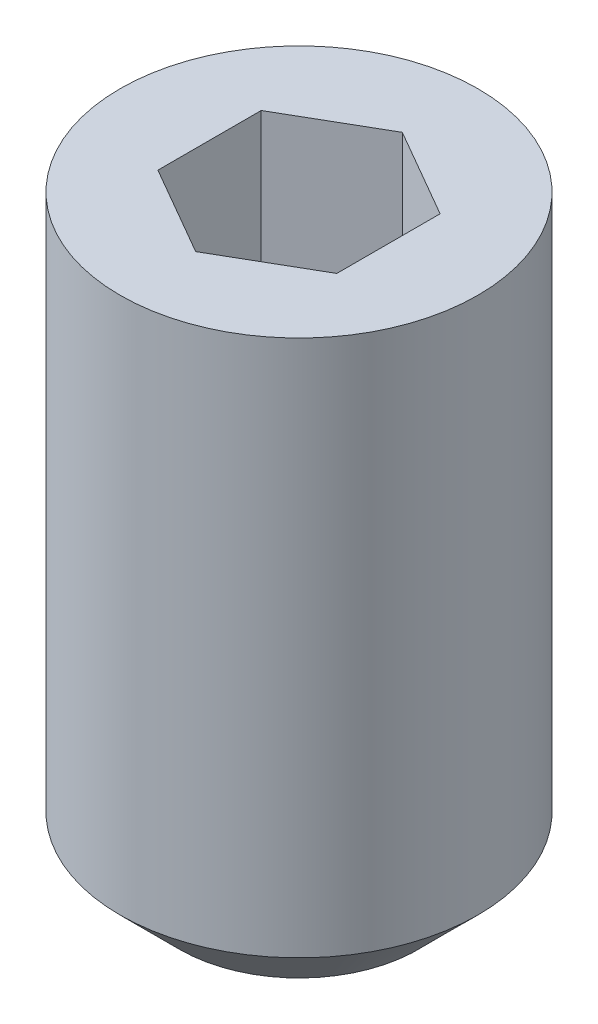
ISO-10303-21;
HEADER;
FILE_DESCRIPTION(('STEP AP214'),'2;1');
FILE_NAME('part.step','',(''),(''),'','','');
FILE_SCHEMA(('AUTOMOTIVE_DESIGN { 1 0 10303 214 1 1 1 1 }'));
ENDSEC;
DATA;
#1=APPLICATION_CONTEXT('core data for automotive mechanical design processes');
#2=APPLICATION_PROTOCOL_DEFINITION('international standard','automotive_design',2000,#1);
#3=PRODUCT_CONTEXT('',#1,'mechanical');
#4=PRODUCT('Part','Part','',(#3));
#5=PRODUCT_RELATED_PRODUCT_CATEGORY('part','',(#4));
#6=PRODUCT_DEFINITION_FORMATION('','',#4);
#7=PRODUCT_DEFINITION_CONTEXT('part definition',#1,'design');
#8=PRODUCT_DEFINITION('design','',#6,#7);
#9=PRODUCT_DEFINITION_SHAPE('','',#8);
#10=(LENGTH_UNIT() NAMED_UNIT(*) SI_UNIT(.MILLI.,.METRE.));
#11=(NAMED_UNIT(*) PLANE_ANGLE_UNIT() SI_UNIT($,.RADIAN.));
#12=(NAMED_UNIT(*) SI_UNIT($,.STERADIAN.) SOLID_ANGLE_UNIT());
#13=UNCERTAINTY_MEASURE_WITH_UNIT(LENGTH_MEASURE(1.E-05),#10,'distance_accuracy_value','');
#14=(GEOMETRIC_REPRESENTATION_CONTEXT(3) GLOBAL_UNCERTAINTY_ASSIGNED_CONTEXT((#13)) GLOBAL_UNIT_ASSIGNED_CONTEXT((#10,
#11,#12)) REPRESENTATION_CONTEXT('',''));
#15=CARTESIAN_POINT('',(0.,0.,0.));
#16=DIRECTION('',(0.,0.,1.));
#17=DIRECTION('',(1.,0.,0.));
#18=AXIS2_PLACEMENT_3D('',#15,#16,#17);
#19=CARTESIAN_POINT('',(0.750000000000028,-3.79166666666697,0.));
#20=DIRECTION('',(0.362446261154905,-0.932004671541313,0.));
#21=DIRECTION('',(0.932004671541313,0.362446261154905,0.));
#22=AXIS2_PLACEMENT_3D('',#19,#20,#21);
#23=PLANE('',#22);
#24=DIRECTION('',(0.820729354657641,0.319172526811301,0.473848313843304));
#25=VECTOR('',#24,1.);
#26=CARTESIAN_POINT('',(0.,-4.08333333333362,1.63206308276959E-13));
#27=LINE('',#26,#25);
#28=CARTESIAN_POINT('',(0.,-4.08333333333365,1.38708859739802E-13));
#29=VERTEX_POINT('',#28);
#30=CARTESIAN_POINT('',(1.50000000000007,-3.50000000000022,0.866025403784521));
#31=VERTEX_POINT('',#30);
#32=EDGE_CURVE('E97',#29,#31,#27,.T.);
#33=ORIENTED_EDGE('',*,*,#32,.T.);
#34=DIRECTION('',(0.,0.,1.));
#35=VECTOR('',#34,1.);
#36=CARTESIAN_POINT('',(1.50000000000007,-3.50000000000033,0.));
#37=LINE('',#36,#35);
#38=CARTESIAN_POINT('',(1.50000000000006,-3.50000000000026,-0.866025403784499));
#39=VERTEX_POINT('',#38);
#40=EDGE_CURVE('E69',#39,#31,#37,.T.);
#41=ORIENTED_EDGE('',*,*,#40,.F.);
#42=DIRECTION('',(-0.820729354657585,-0.319172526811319,0.473848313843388));
#43=VECTOR('',#42,1.);
#44=CARTESIAN_POINT('',(1.50000000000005,-3.50000000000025,-0.866025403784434));
#45=LINE('',#44,#43);
#46=EDGE_CURVE('E86',#39,#29,#45,.T.);
#47=ORIENTED_EDGE('',*,*,#46,.T.);
#48=EDGE_LOOP('',(#33,#41,#47));
#49=FACE_BOUND('',#48,.T.);
#50=ADVANCED_FACE('F16',(#49),#23,.F.);
#51=CARTESIAN_POINT('',(0.375000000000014,-3.79166666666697,-0.649519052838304));
#52=DIRECTION('',(0.181223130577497,-0.932004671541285,-0.313887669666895));
#53=DIRECTION('',(0.,0.319172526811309,-0.947696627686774));
#54=AXIS2_PLACEMENT_3D('',#51,#52,#53);
#55=PLANE('',#54);
#56=ORIENTED_EDGE('',*,*,#46,.F.);
#57=DIRECTION('',(0.86602540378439,0.,0.500000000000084));
#58=VECTOR('',#57,1.);
#59=CARTESIAN_POINT('',(0.,-3.50000000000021,-1.73205080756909));
#60=LINE('',#59,#58);
#61=CARTESIAN_POINT('',(0.,-3.50000000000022,-1.73205080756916));
#62=VERTEX_POINT('',#61);
#63=EDGE_CURVE('E75',#62,#39,#60,.T.);
#64=ORIENTED_EDGE('',*,*,#63,.F.);
#65=DIRECTION('',(0.,0.319172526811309,-0.947696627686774));
#66=VECTOR('',#65,1.);
#67=CARTESIAN_POINT('',(0.,-3.85715523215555,-0.671574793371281));
#68=LINE('',#67,#66);
#69=EDGE_CURVE('E101',#62,#29,#68,.F.);
#70=ORIENTED_EDGE('',*,*,#69,.T.);
#71=EDGE_LOOP('',(#56,#64,#70));
#72=FACE_BOUND('',#71,.T.);
#73=ADVANCED_FACE('F100',(#72),#55,.F.);
#74=CARTESIAN_POINT('',(0.375000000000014,-3.79166666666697,0.649519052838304));
#75=DIRECTION('',(0.181223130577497,-0.932004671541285,0.313887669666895));
#76=DIRECTION('',(0.,-0.319172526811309,-0.947696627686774));
#77=AXIS2_PLACEMENT_3D('',#74,#75,#76);
#78=PLANE('',#77);
#79=DIRECTION('',(0.,-0.319172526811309,-0.947696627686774));
#80=VECTOR('',#79,1.);
#81=CARTESIAN_POINT('',(-1.18015406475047E-13,-3.85715523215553,0.671574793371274));
#82=LINE('',#81,#80);
#83=CARTESIAN_POINT('',(0.,-3.50000000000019,1.73205080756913));
#84=VERTEX_POINT('',#83);
#85=EDGE_CURVE('E142',#29,#84,#82,.F.);
#86=ORIENTED_EDGE('',*,*,#85,.T.);
#87=DIRECTION('',(-0.866025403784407,0.,0.500000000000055));
#88=VECTOR('',#87,1.);
#89=CARTESIAN_POINT('',(1.50000000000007,-3.50000000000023,0.866025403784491));
#90=LINE('',#89,#88);
#91=EDGE_CURVE('E102',#31,#84,#90,.T.);
#92=ORIENTED_EDGE('',*,*,#91,.F.);
#93=ORIENTED_EDGE('',*,*,#32,.F.);
#94=EDGE_LOOP('',(#86,#92,#93));
#95=FACE_BOUND('',#94,.T.);
#96=ADVANCED_FACE('F172',(#95),#78,.F.);
#97=CARTESIAN_POINT('',(-0.375000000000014,-3.79166666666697,-0.649519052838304));
#98=DIRECTION('',(-0.181223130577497,-0.932004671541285,-0.313887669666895));
#99=DIRECTION('',(0.,0.319172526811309,-0.947696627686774));
#100=AXIS2_PLACEMENT_3D('',#97,#98,#99);
#101=PLANE('',#100);
#102=ORIENTED_EDGE('',*,*,#69,.F.);
#103=DIRECTION('',(0.86602540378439,0.,-0.500000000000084));
#104=VECTOR('',#103,1.);
#105=CARTESIAN_POINT('',(-1.50000000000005,-3.50000000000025,-0.866025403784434));
#106=LINE('',#105,#104);
#107=CARTESIAN_POINT('',(-1.50000000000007,-3.50000000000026,-0.866025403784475));
#108=VERTEX_POINT('',#107);
#109=EDGE_CURVE('E148',#108,#62,#106,.T.);
#110=ORIENTED_EDGE('',*,*,#109,.F.);
#111=DIRECTION('',(0.820729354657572,-0.319172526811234,0.473848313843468));
#112=VECTOR('',#111,1.);
#113=CARTESIAN_POINT('',(-1.50000000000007,-3.50000000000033,-0.866025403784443));
#114=LINE('',#113,#112);
#115=EDGE_CURVE('E139',#108,#29,#114,.T.);
#116=ORIENTED_EDGE('',*,*,#115,.T.);
#117=EDGE_LOOP('',(#102,#110,#116));
#118=FACE_BOUND('',#117,.T.);
#119=ADVANCED_FACE('F155',(#118),#101,.F.);
#120=CARTESIAN_POINT('',(-0.375000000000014,-3.79166666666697,0.649519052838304));
#121=DIRECTION('',(-0.181223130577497,-0.932004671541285,0.313887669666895));
#122=DIRECTION('',(0.,-0.319172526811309,-0.947696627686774));
#123=AXIS2_PLACEMENT_3D('',#120,#121,#122);
#124=PLANE('',#123);
#125=DIRECTION('',(-0.820729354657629,0.319172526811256,0.473848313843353));
#126=VECTOR('',#125,1.);
#127=CARTESIAN_POINT('',(-1.15792792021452E-13,-4.08333333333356,1.38777878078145E-13));
#128=LINE('',#127,#126);
#129=CARTESIAN_POINT('',(-1.50000000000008,-3.50000000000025,0.866025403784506));
#130=VERTEX_POINT('',#129);
#131=EDGE_CURVE('E136',#29,#130,#128,.T.);
#132=ORIENTED_EDGE('',*,*,#131,.T.);
#133=DIRECTION('',(-0.866025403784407,0.,-0.500000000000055));
#134=VECTOR('',#133,1.);
#135=CARTESIAN_POINT('',(0.,-3.50000000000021,1.73205080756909));
#136=LINE('',#135,#134);
#137=EDGE_CURVE('E145',#84,#130,#136,.T.);
#138=ORIENTED_EDGE('',*,*,#137,.F.);
#139=ORIENTED_EDGE('',*,*,#85,.F.);
#140=EDGE_LOOP('',(#132,#138,#139));
#141=FACE_BOUND('',#140,.T.);
#142=ADVANCED_FACE('F170',(#141),#124,.F.);
#143=CARTESIAN_POINT('',(-0.750000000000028,-3.79166666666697,0.));
#144=DIRECTION('',(-0.362446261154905,-0.932004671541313,0.));
#145=DIRECTION('',(0.932004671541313,-0.362446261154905,0.));
#146=AXIS2_PLACEMENT_3D('',#143,#144,#145);
#147=PLANE('',#146);
#148=ORIENTED_EDGE('',*,*,#115,.F.);
#149=DIRECTION('',(0.,0.,1.));
#150=VECTOR('',#149,1.);
#151=CARTESIAN_POINT('',(-1.49999999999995,-3.50000000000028,0.));
#152=LINE('',#151,#150);
#153=EDGE_CURVE('E131',#108,#130,#152,.T.);
#154=ORIENTED_EDGE('',*,*,#153,.T.);
#155=ORIENTED_EDGE('',*,*,#131,.F.);
#156=EDGE_LOOP('',(#148,#154,#155));
#157=FACE_BOUND('',#156,.T.);
#158=ADVANCED_FACE('F160',(#157),#147,.F.);
#159=CARTESIAN_POINT('',(-1.49999999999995,-1.75000000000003,0.));
#160=DIRECTION('',(-1.,0.,0.));
#161=DIRECTION('',(0.,-1.,0.));
#162=AXIS2_PLACEMENT_3D('',#159,#160,#161);
#163=PLANE('',#162);
#164=DIRECTION('',(0.,1.,0.));
#165=VECTOR('',#164,1.);
#166=CARTESIAN_POINT('',(-1.50000000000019,-1.75000000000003,-0.866025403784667));
#167=LINE('',#166,#165);
#168=CARTESIAN_POINT('',(-1.50000000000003,0.,-0.86602540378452));
#169=VERTEX_POINT('',#168);
#170=EDGE_CURVE('E128',#108,#169,#167,.T.);
#171=ORIENTED_EDGE('',*,*,#170,.T.);
#172=DIRECTION('',(0.,0.,1.));
#173=VECTOR('',#172,1.);
#174=CARTESIAN_POINT('',(-1.49999999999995,0.,0.));
#175=LINE('',#174,#173);
#176=CARTESIAN_POINT('',(-1.50000000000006,0.,0.866025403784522));
#177=VERTEX_POINT('',#176);
#178=EDGE_CURVE('E134',#177,#169,#175,.F.);
#179=ORIENTED_EDGE('',*,*,#178,.F.);
#180=DIRECTION('',(0.,1.,0.));
#181=VECTOR('',#180,1.);
#182=CARTESIAN_POINT('',(-1.50000000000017,-1.75000000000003,0.866025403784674));
#183=LINE('',#182,#181);
#184=EDGE_CURVE('E121',#177,#130,#183,.F.);
#185=ORIENTED_EDGE('',*,*,#184,.T.);
#186=ORIENTED_EDGE('',*,*,#153,.F.);
#187=EDGE_LOOP('',(#171,#179,#185,#186));
#188=FACE_BOUND('',#187,.T.);
#189=ADVANCED_FACE('F162',(#188),#163,.F.);
#190=CARTESIAN_POINT('',(-0.750000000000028,-1.75000000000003,-1.299038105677));
#191=DIRECTION('',(-0.500000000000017,0.,-0.866025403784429));
#192=DIRECTION('',(-0.866025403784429,0.,0.500000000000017));
#193=AXIS2_PLACEMENT_3D('',#190,#191,#192);
#194=PLANE('',#193);
#195=DIRECTION('',(0.,1.,0.));
#196=VECTOR('',#195,1.);
#197=CARTESIAN_POINT('',(0.,-1.75000000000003,-1.73205080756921));
#198=LINE('',#197,#196);
#199=CARTESIAN_POINT('',(0.,0.,-1.73205080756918));
#200=VERTEX_POINT('',#199);
#201=EDGE_CURVE('E81',#62,#200,#198,.T.);
#202=ORIENTED_EDGE('',*,*,#201,.T.);
#203=DIRECTION('',(-0.866025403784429,0.,0.500000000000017));
#204=VECTOR('',#203,1.);
#205=CARTESIAN_POINT('',(-0.750000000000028,0.,-1.299038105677));
#206=LINE('',#205,#204);
#207=EDGE_CURVE('E126',#169,#200,#206,.F.);
#208=ORIENTED_EDGE('',*,*,#207,.F.);
#209=ORIENTED_EDGE('',*,*,#170,.F.);
#210=ORIENTED_EDGE('',*,*,#109,.T.);
#211=EDGE_LOOP('',(#202,#208,#209,#210));
#212=FACE_BOUND('',#211,.T.);
#213=ADVANCED_FACE('F151',(#212),#194,.F.);
#214=CARTESIAN_POINT('',(-0.750000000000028,-1.75000000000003,1.299038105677));
#215=DIRECTION('',(-0.500000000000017,0.,0.866025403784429));
#216=DIRECTION('',(0.866025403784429,0.,0.500000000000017));
#217=AXIS2_PLACEMENT_3D('',#214,#215,#216);
#218=PLANE('',#217);
#219=ORIENTED_EDGE('',*,*,#184,.F.);
#220=DIRECTION('',(0.866025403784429,0.,0.500000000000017));
#221=VECTOR('',#220,1.);
#222=CARTESIAN_POINT('',(-0.750000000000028,0.,1.299038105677));
#223=LINE('',#222,#221);
#224=CARTESIAN_POINT('',(0.,0.,1.73205080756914));
#225=VERTEX_POINT('',#224);
#226=EDGE_CURVE('E124',#225,#177,#223,.F.);
#227=ORIENTED_EDGE('',*,*,#226,.F.);
#228=DIRECTION('',(0.,1.,0.));
#229=VECTOR('',#228,1.);
#230=CARTESIAN_POINT('',(0.,-1.75000000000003,1.73205080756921));
#231=LINE('',#230,#229);
#232=EDGE_CURVE('E92',#225,#84,#231,.F.);
#233=ORIENTED_EDGE('',*,*,#232,.T.);
#234=ORIENTED_EDGE('',*,*,#137,.T.);
#235=EDGE_LOOP('',(#219,#227,#233,#234));
#236=FACE_BOUND('',#235,.T.);
#237=ADVANCED_FACE('F167',(#236),#218,.F.);
#238=CARTESIAN_POINT('',(0.750000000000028,-1.75000000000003,-1.299038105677));
#239=DIRECTION('',(0.500000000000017,0.,-0.866025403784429));
#240=DIRECTION('',(-0.866025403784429,0.,-0.500000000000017));
#241=AXIS2_PLACEMENT_3D('',#238,#239,#240);
#242=PLANE('',#241);
#243=DIRECTION('',(0.,1.,0.));
#244=VECTOR('',#243,1.);
#245=CARTESIAN_POINT('',(1.49999999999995,-1.75000000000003,-0.866025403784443));
#246=LINE('',#245,#244);
#247=CARTESIAN_POINT('',(1.50000000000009,0.,-0.866025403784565));
#248=VERTEX_POINT('',#247);
#249=EDGE_CURVE('E78',#39,#248,#246,.T.);
#250=ORIENTED_EDGE('',*,*,#249,.T.);
#251=DIRECTION('',(-0.866025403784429,0.,-0.500000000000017));
#252=VECTOR('',#251,1.);
#253=CARTESIAN_POINT('',(0.750000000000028,0.,-1.299038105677));
#254=LINE('',#253,#252);
#255=EDGE_CURVE('E118',#200,#248,#254,.F.);
#256=ORIENTED_EDGE('',*,*,#255,.F.);
#257=ORIENTED_EDGE('',*,*,#201,.F.);
#258=ORIENTED_EDGE('',*,*,#63,.T.);
#259=EDGE_LOOP('',(#250,#256,#257,#258));
#260=FACE_BOUND('',#259,.T.);
#261=ADVANCED_FACE('F76',(#260),#242,.F.);
#262=CARTESIAN_POINT('',(0.750000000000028,-1.75000000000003,1.299038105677));
#263=DIRECTION('',(0.500000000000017,0.,0.866025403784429));
#264=DIRECTION('',(0.866025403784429,0.,-0.500000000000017));
#265=AXIS2_PLACEMENT_3D('',#262,#263,#264);
#266=PLANE('',#265);
#267=ORIENTED_EDGE('',*,*,#232,.F.);
#268=DIRECTION('',(0.866025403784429,0.,-0.500000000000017));
#269=VECTOR('',#268,1.);
#270=CARTESIAN_POINT('',(0.750000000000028,0.,1.299038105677));
#271=LINE('',#270,#269);
#272=CARTESIAN_POINT('',(1.50000000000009,0.,0.866025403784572));
#273=VERTEX_POINT('',#272);
#274=EDGE_CURVE('E34',#273,#225,#271,.F.);
#275=ORIENTED_EDGE('',*,*,#274,.F.);
#276=DIRECTION('',(0.,1.,0.));
#277=VECTOR('',#276,1.);
#278=CARTESIAN_POINT('',(1.49999999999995,-1.75000000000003,0.866025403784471));
#279=LINE('',#278,#277);
#280=EDGE_CURVE('E91',#273,#31,#279,.F.);
#281=ORIENTED_EDGE('',*,*,#280,.T.);
#282=ORIENTED_EDGE('',*,*,#91,.T.);
#283=EDGE_LOOP('',(#267,#275,#281,#282));
#284=FACE_BOUND('',#283,.T.);
#285=ADVANCED_FACE('F173',(#284),#266,.F.);
#286=CARTESIAN_POINT('',(1.49999999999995,-1.75000000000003,0.));
#287=DIRECTION('',(1.,0.,0.));
#288=DIRECTION('',(0.,1.,0.));
#289=AXIS2_PLACEMENT_3D('',#286,#287,#288);
#290=PLANE('',#289);
#291=ORIENTED_EDGE('',*,*,#280,.F.);
#292=DIRECTION('',(0.,0.,-1.));
#293=VECTOR('',#292,1.);
#294=CARTESIAN_POINT('',(1.50000000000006,0.,0.));
#295=LINE('',#294,#293);
#296=EDGE_CURVE('E90',#273,#248,#295,.T.);
#297=ORIENTED_EDGE('',*,*,#296,.T.);
#298=ORIENTED_EDGE('',*,*,#249,.F.);
#299=ORIENTED_EDGE('',*,*,#40,.T.);
#300=EDGE_LOOP('',(#291,#297,#298,#299));
#301=FACE_BOUND('',#300,.T.);
#302=ADVANCED_FACE('F88',(#301),#290,.F.);
#303=CARTESIAN_POINT('',(0.,-10.,0.));
#304=DIRECTION('',(0.,-1.,0.));
#305=DIRECTION('',(0.,0.,-1.));
#306=AXIS2_PLACEMENT_3D('',#303,#304,#305);
#307=PLANE('',#306);
#308=CARTESIAN_POINT('',(0.,-9.99999999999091,0.));
#309=DIRECTION('',(0.,1.,0.));
#310=DIRECTION('',(0.,0.,1.));
#311=AXIS2_PLACEMENT_3D('',#308,#309,#310);
#312=CIRCLE('',#311,1.99999999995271);
#313=CARTESIAN_POINT('',(0.,-9.99999999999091,1.99999999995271));
#314=VERTEX_POINT('',#313);
#315=EDGE_CURVE('E19',#314,#314,#312,.T.);
#316=ORIENTED_EDGE('',*,*,#315,.F.);
#317=EDGE_LOOP('',(#316));
#318=FACE_BOUND('',#317,.T.);
#319=ADVANCED_FACE('F178',(#318),#307,.T.);
#320=CARTESIAN_POINT('',(0.,0.,0.));
#321=DIRECTION('',(0.,-1.,0.));
#322=DIRECTION('',(0.,0.,-1.));
#323=AXIS2_PLACEMENT_3D('',#320,#321,#322);
#324=PLANE('',#323);
#325=CARTESIAN_POINT('',(0.,0.,0.));
#326=DIRECTION('',(0.,-1.,0.));
#327=DIRECTION('',(0.,0.,-1.));
#328=AXIS2_PLACEMENT_3D('',#325,#326,#327);
#329=CIRCLE('',#328,3.);
#330=CARTESIAN_POINT('',(0.,0.,-3.));
#331=VERTEX_POINT('',#330);
#332=EDGE_CURVE('E25',#331,#331,#329,.T.);
#333=ORIENTED_EDGE('',*,*,#332,.F.);
#334=EDGE_LOOP('',(#333));
#335=FACE_BOUND('',#334,.T.);
#336=ORIENTED_EDGE('',*,*,#274,.T.);
#337=ORIENTED_EDGE('',*,*,#226,.T.);
#338=ORIENTED_EDGE('',*,*,#178,.T.);
#339=ORIENTED_EDGE('',*,*,#207,.T.);
#340=ORIENTED_EDGE('',*,*,#255,.T.);
#341=ORIENTED_EDGE('',*,*,#296,.F.);
#342=EDGE_LOOP('',(#336,#337,#338,#339,#340,#341));
#343=FACE_BOUND('',#342,.T.);
#344=ADVANCED_FACE('F175',(#335,#343),#324,.F.);
#345=CARTESIAN_POINT('',(0.,-8.99999999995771,0.));
#346=DIRECTION('',(0.,1.,0.));
#347=DIRECTION('',(0.,0.,1.));
#348=AXIS2_PLACEMENT_3D('',#345,#346,#347);
#349=CONICAL_SURFACE('',#348,2.9999999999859,0.785398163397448);
#350=CARTESIAN_POINT('',(0.,-9.00000000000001,0.));
#351=DIRECTION('',(0.,-1.,0.));
#352=DIRECTION('',(0.,0.,-1.));
#353=AXIS2_PLACEMENT_3D('',#350,#351,#352);
#354=CIRCLE('',#353,3.);
#355=CARTESIAN_POINT('',(0.,-9.00000000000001,-3.));
#356=VERTEX_POINT('',#355);
#357=EDGE_CURVE('E11',#356,#356,#354,.F.);
#358=ORIENTED_EDGE('',*,*,#357,.F.);
#359=EDGE_LOOP('',(#358));
#360=FACE_BOUND('',#359,.T.);
#361=ORIENTED_EDGE('',*,*,#315,.T.);
#362=EDGE_LOOP('',(#361));
#363=FACE_BOUND('',#362,.T.);
#364=ADVANCED_FACE('F177',(#360,#363),#349,.T.);
#365=CARTESIAN_POINT('',(0.,0.499999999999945,0.));
#366=DIRECTION('',(0.,-1.,0.));
#367=DIRECTION('',(0.,0.,-1.));
#368=AXIS2_PLACEMENT_3D('',#365,#366,#367);
#369=CYLINDRICAL_SURFACE('',#368,3.);
#370=ORIENTED_EDGE('',*,*,#357,.T.);
#371=EDGE_LOOP('',(#370));
#372=FACE_BOUND('',#371,.T.);
#373=ORIENTED_EDGE('',*,*,#332,.T.);
#374=EDGE_LOOP('',(#373));
#375=FACE_BOUND('',#374,.T.);
#376=ADVANCED_FACE('F186',(#372,#375),#369,.T.);
#377=CLOSED_SHELL('',(#50,#73,#96,#119,#142,#158,#189,#213,#237,#261,#285,#302,#319,#344,#364,#376));
#378=MANIFOLD_SOLID_BREP('B1',#377);
#379=ADVANCED_BREP_SHAPE_REPRESENTATION('',(#18,#378),#14);
#380=SHAPE_DEFINITION_REPRESENTATION(#9,#379);
ENDSEC;
END-ISO-10303-21;
